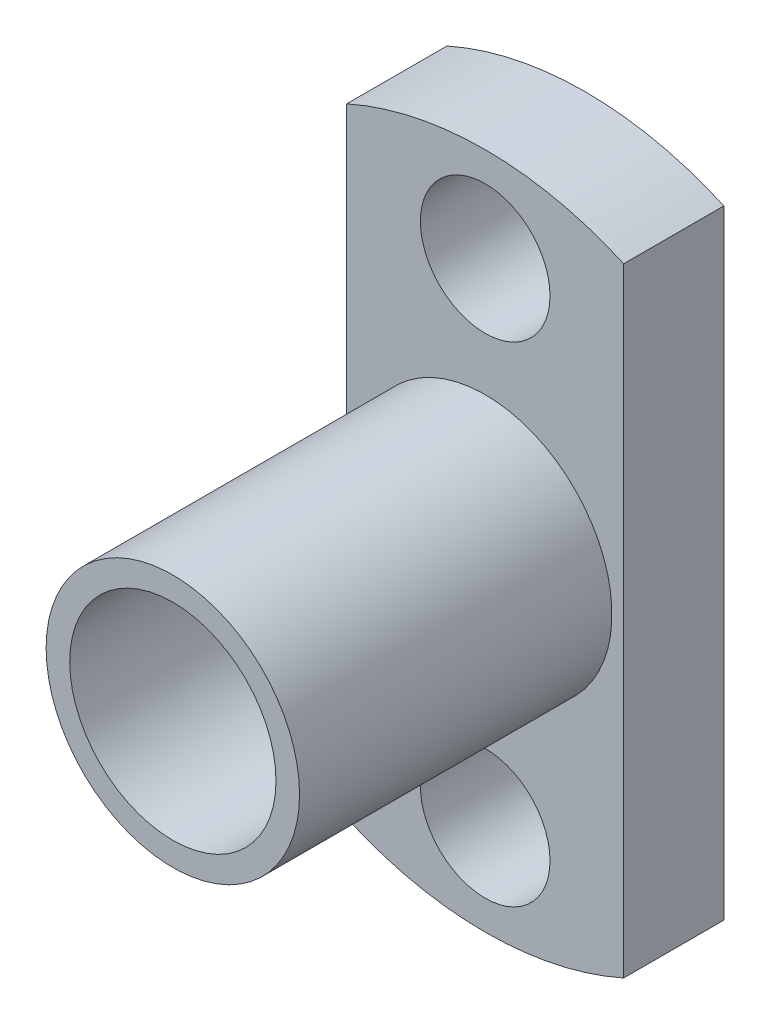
from build123d import *

# Parameters (mm, degrees)
EXTRUDE_1_DEPTH     = 1.7
SKETCH_2_R          = 2.15
EXTRUDE_2_DEPTH     = 5.3
SKETCH_3_R          = 1.75
CUT_EXTRUDE_1_DEPTH = 3.3
SKETCH_4_R          = 0.19
EXTRUDE_3_DEPTH     = 1
SKETCH_5_R          = 1.1
CUT_EXTRUDE_2_DEPTH = 9.165476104
SKETCH_6_R          = 0.19
CUT_EXTRUDE_3_DEPTH = 1


with BuildPart() as part:
    # Sketch 1 → Extrude 1 (new body)
    with BuildSketch(Plane.XY):
        with BuildLine():
            Line((2.35, 0), (2.35, 5.247856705))
            ThreePointArc((2.35, 5.247856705), (0, 5.75), (-2.35, 5.247856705))
            Line((-2.35, 5.247856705), (-2.35, -5.247856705))
            ThreePointArc((-2.35, -5.247856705), (0, -5.75), (2.35, -5.247856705))
            Line((2.35, -5.247856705), (2.35, 0))
        make_face()
    extrude(amount=EXTRUDE_1_DEPTH)

    # Sketch 2 → Extrude 2 (add)
    with BuildSketch(Plane.XY.offset(1.7)):
        with Locations(Location((0, 0, 0), (0, 0, 180))):
            Circle(SKETCH_2_R)
    extrude(amount=EXTRUDE_2_DEPTH)

    # Sketch 3 → Cut-Extrude 1 (cut)
    with BuildSketch(Plane.XY.offset(7)):
        Circle(SKETCH_3_R)
    extrude(amount=-CUT_EXTRUDE_1_DEPTH, mode=Mode.SUBTRACT)

    # Sketch 4 → Extrude 3 (add)
    with BuildSketch(Plane.XY.offset(3.7)):
        Circle(SKETCH_4_R)
    extrude(amount=EXTRUDE_3_DEPTH)

    # Sketch 5 → Cut-Extrude 2 (cut, through all)
    with BuildSketch(Plane.XY.offset(1.7)):
        with Locations((0, 4.15)):
            Circle(SKETCH_5_R)
        with Locations((0, -4.15)):
            Circle(SKETCH_5_R)
    extrude(amount=-CUT_EXTRUDE_2_DEPTH, mode=Mode.SUBTRACT)

    # Sketch 6 → Cut-Extrude 3 (cut)
    with BuildSketch(Plane(origin=(0, 0, 0), x_dir=(-1, 0, 0), z_dir=(0, 0, -1))):
        with Locations(Location((0, 0, 0), (0, 0, 180))):
            Circle(SKETCH_6_R)
    extrude(amount=-CUT_EXTRUDE_3_DEPTH, mode=Mode.SUBTRACT)


solid = part.part
